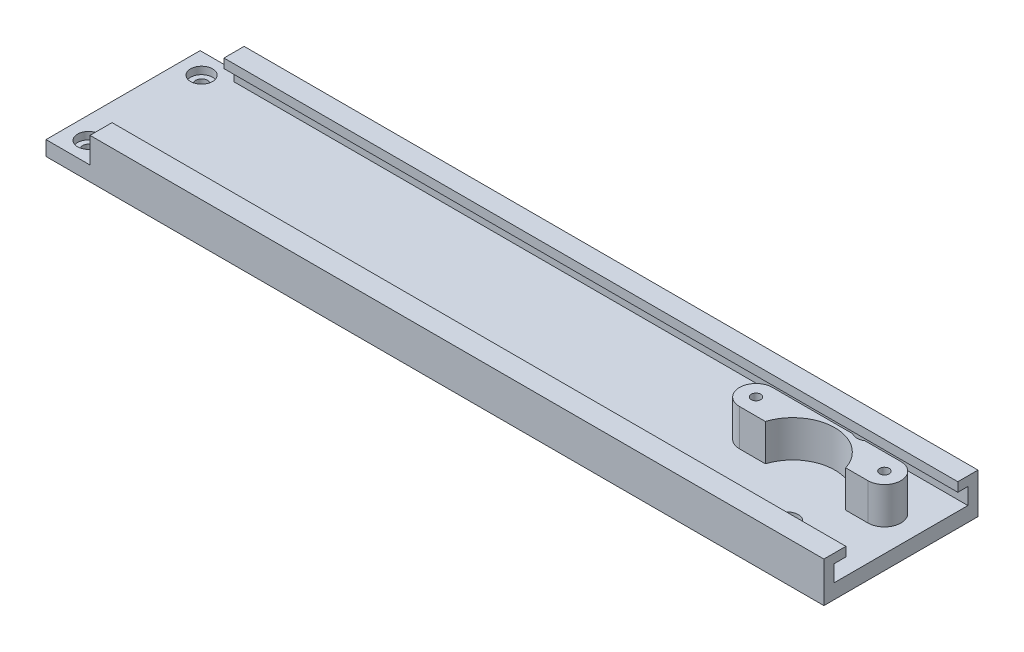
ISO-10303-21;
HEADER;
FILE_DESCRIPTION(('STEP AP214'),'2;1');
FILE_NAME('part.step','',(''),(''),'','','');
FILE_SCHEMA(('AUTOMOTIVE_DESIGN { 1 0 10303 214 1 1 1 1 }'));
ENDSEC;
DATA;
#1=APPLICATION_CONTEXT('core data for automotive mechanical design processes');
#2=APPLICATION_PROTOCOL_DEFINITION('international standard','automotive_design',2000,#1);
#3=PRODUCT_CONTEXT('',#1,'mechanical');
#4=PRODUCT('Part','Part','',(#3));
#5=PRODUCT_RELATED_PRODUCT_CATEGORY('part','',(#4));
#6=PRODUCT_DEFINITION_FORMATION('','',#4);
#7=PRODUCT_DEFINITION_CONTEXT('part definition',#1,'design');
#8=PRODUCT_DEFINITION('design','',#6,#7);
#9=PRODUCT_DEFINITION_SHAPE('','',#8);
#10=(LENGTH_UNIT() NAMED_UNIT(*) SI_UNIT(.MILLI.,.METRE.));
#11=(NAMED_UNIT(*) PLANE_ANGLE_UNIT() SI_UNIT($,.RADIAN.));
#12=(NAMED_UNIT(*) SI_UNIT($,.STERADIAN.) SOLID_ANGLE_UNIT());
#13=UNCERTAINTY_MEASURE_WITH_UNIT(LENGTH_MEASURE(1.E-05),#10,'distance_accuracy_value','');
#14=(GEOMETRIC_REPRESENTATION_CONTEXT(3) GLOBAL_UNCERTAINTY_ASSIGNED_CONTEXT((#13)) GLOBAL_UNIT_ASSIGNED_CONTEXT((#10,
#11,#12)) REPRESENTATION_CONTEXT('',''));
#15=CARTESIAN_POINT('',(0.,0.,0.));
#16=DIRECTION('',(0.,0.,1.));
#17=DIRECTION('',(1.,0.,0.));
#18=AXIS2_PLACEMENT_3D('',#15,#16,#17);
#19=CARTESIAN_POINT('',(61.5,14.,-9.49999999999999));
#20=DIRECTION('',(0.,0.,1.));
#21=DIRECTION('',(1.,0.,0.));
#22=AXIS2_PLACEMENT_3D('',#19,#20,#21);
#23=PLANE('',#22);
#24=DIRECTION('',(-1.,0.,0.));
#25=VECTOR('',#24,1.);
#26=CARTESIAN_POINT('',(61.5,4.,-9.49999999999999));
#27=LINE('',#26,#25);
#28=CARTESIAN_POINT('',(96.5,4.,-9.49999999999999));
#29=VERTEX_POINT('',#28);
#30=CARTESIAN_POINT('',(86.6583123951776,4.,-9.49999999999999));
#31=VERTEX_POINT('',#30);
#32=EDGE_CURVE('E208',#29,#31,#27,.T.);
#33=ORIENTED_EDGE('',*,*,#32,.T.);
#34=DIRECTION('',(0.,1.,0.));
#35=VECTOR('',#34,1.);
#36=CARTESIAN_POINT('',(86.6583123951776,-0.000999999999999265,-9.49999999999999));
#37=LINE('',#36,#35);
#38=CARTESIAN_POINT('',(86.6583123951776,14.,-9.49999999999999));
#39=VERTEX_POINT('',#38);
#40=EDGE_CURVE('E195',#39,#31,#37,.F.);
#41=ORIENTED_EDGE('',*,*,#40,.F.);
#42=DIRECTION('',(-1.,0.,0.));
#43=VECTOR('',#42,1.);
#44=CARTESIAN_POINT('',(61.5,14.,-9.49999999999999));
#45=LINE('',#44,#43);
#46=CARTESIAN_POINT('',(96.5,14.,-9.49999999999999));
#47=VERTEX_POINT('',#46);
#48=EDGE_CURVE('E207',#47,#39,#45,.T.);
#49=ORIENTED_EDGE('',*,*,#48,.F.);
#50=DIRECTION('',(0.,-1.,0.));
#51=VECTOR('',#50,1.);
#52=CARTESIAN_POINT('',(96.5,14.,-9.49999999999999));
#53=LINE('',#52,#51);
#54=EDGE_CURVE('E219',#47,#29,#53,.T.);
#55=ORIENTED_EDGE('',*,*,#54,.T.);
#56=EDGE_LOOP('',(#33,#41,#49,#55));
#57=FACE_BOUND('',#56,.T.);
#58=ADVANCED_FACE('F42',(#57),#23,.F.);
#59=CARTESIAN_POINT('',(61.5,14.,-0.499999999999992));
#60=DIRECTION('',(0.,0.,-1.));
#61=DIRECTION('',(-1.,0.,0.));
#62=AXIS2_PLACEMENT_3D('',#59,#60,#61);
#63=PLANE('',#62);
#64=DIRECTION('',(1.,0.,0.));
#65=VECTOR('',#64,1.);
#66=CARTESIAN_POINT('',(61.5,4.,-0.499999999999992));
#67=LINE('',#66,#65);
#68=CARTESIAN_POINT('',(61.5,4.,-0.499999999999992));
#69=VERTEX_POINT('',#68);
#70=CARTESIAN_POINT('',(68.5455488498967,4.,-0.499999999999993));
#71=VERTEX_POINT('',#70);
#72=EDGE_CURVE('E64',#69,#71,#67,.T.);
#73=ORIENTED_EDGE('',*,*,#72,.T.);
#74=DIRECTION('',(0.,1.,0.));
#75=VECTOR('',#74,1.);
#76=CARTESIAN_POINT('',(68.5455488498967,-28.5269119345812,-0.499999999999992));
#77=LINE('',#76,#75);
#78=CARTESIAN_POINT('',(68.5455488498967,14.,-0.499999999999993));
#79=VERTEX_POINT('',#78);
#80=EDGE_CURVE('E11',#71,#79,#77,.T.);
#81=ORIENTED_EDGE('',*,*,#80,.T.);
#82=DIRECTION('',(1.,0.,0.));
#83=VECTOR('',#82,1.);
#84=CARTESIAN_POINT('',(61.5,14.,-0.499999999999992));
#85=LINE('',#84,#83);
#86=CARTESIAN_POINT('',(61.5,14.,-0.499999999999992));
#87=VERTEX_POINT('',#86);
#88=EDGE_CURVE('E386',#87,#79,#85,.T.);
#89=ORIENTED_EDGE('',*,*,#88,.F.);
#90=DIRECTION('',(0.,-1.,0.));
#91=VECTOR('',#90,1.);
#92=CARTESIAN_POINT('',(61.5,14.,-0.499999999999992));
#93=LINE('',#92,#91);
#94=EDGE_CURVE('E240',#87,#69,#93,.T.);
#95=ORIENTED_EDGE('',*,*,#94,.T.);
#96=EDGE_LOOP('',(#73,#81,#89,#95));
#97=FACE_BOUND('',#96,.T.);
#98=ADVANCED_FACE('F429',(#97),#63,.F.);
#99=CARTESIAN_POINT('',(-106.,4.,21.));
#100=DIRECTION('',(-1.,0.,0.));
#101=DIRECTION('',(0.,0.,1.));
#102=AXIS2_PLACEMENT_3D('',#99,#100,#101);
#103=PLANE('',#102);
#104=DIRECTION('',(0.,0.,-1.));
#105=VECTOR('',#104,1.);
#106=CARTESIAN_POINT('',(-106.,0.,21.));
#107=LINE('',#106,#105);
#108=CARTESIAN_POINT('',(-106.,0.,21.));
#109=VERTEX_POINT('',#108);
#110=CARTESIAN_POINT('',(-106.,0.,-21.));
#111=VERTEX_POINT('',#110);
#112=EDGE_CURVE('E345',#109,#111,#107,.T.);
#113=ORIENTED_EDGE('',*,*,#112,.F.);
#114=DIRECTION('',(0.,-1.,0.));
#115=VECTOR('',#114,1.);
#116=CARTESIAN_POINT('',(-106.,4.,21.));
#117=LINE('',#116,#115);
#118=CARTESIAN_POINT('',(-106.,4.,21.));
#119=VERTEX_POINT('',#118);
#120=EDGE_CURVE('E366',#119,#109,#117,.T.);
#121=ORIENTED_EDGE('',*,*,#120,.F.);
#122=DIRECTION('',(0.,0.,-1.));
#123=VECTOR('',#122,1.);
#124=CARTESIAN_POINT('',(-106.,4.,21.));
#125=LINE('',#124,#123);
#126=CARTESIAN_POINT('',(-106.,4.,-21.));
#127=VERTEX_POINT('',#126);
#128=EDGE_CURVE('E346',#119,#127,#125,.T.);
#129=ORIENTED_EDGE('',*,*,#128,.T.);
#130=DIRECTION('',(0.,-1.,0.));
#131=VECTOR('',#130,1.);
#132=CARTESIAN_POINT('',(-106.,4.,-21.));
#133=LINE('',#132,#131);
#134=EDGE_CURVE('E357',#127,#111,#133,.T.);
#135=ORIENTED_EDGE('',*,*,#134,.T.);
#136=EDGE_LOOP('',(#113,#121,#129,#135));
#137=FACE_BOUND('',#136,.T.);
#138=ADVANCED_FACE('F44',(#137),#103,.T.);
#139=CARTESIAN_POINT('',(-106.,4.,21.));
#140=DIRECTION('',(0.,0.,-1.));
#141=DIRECTION('',(-1.,0.,0.));
#142=AXIS2_PLACEMENT_3D('',#139,#140,#141);
#143=PLANE('',#142);
#144=DIRECTION('',(1.,0.,0.));
#145=VECTOR('',#144,1.);
#146=CARTESIAN_POINT('',(-106.,0.,21.));
#147=LINE('',#146,#145);
#148=CARTESIAN_POINT('',(106.,0.,21.));
#149=VERTEX_POINT('',#148);
#150=EDGE_CURVE('E350',#109,#149,#147,.T.);
#151=ORIENTED_EDGE('',*,*,#150,.T.);
#152=DIRECTION('',(0.,-1.,0.));
#153=VECTOR('',#152,1.);
#154=CARTESIAN_POINT('',(106.,4.,21.));
#155=LINE('',#154,#153);
#156=CARTESIAN_POINT('',(106.,11.,21.));
#157=VERTEX_POINT('',#156);
#158=EDGE_CURVE('E368',#157,#149,#155,.T.);
#159=ORIENTED_EDGE('',*,*,#158,.F.);
#160=DIRECTION('',(1.,0.,0.));
#161=VECTOR('',#160,1.);
#162=CARTESIAN_POINT('',(-94.,11.,21.));
#163=LINE('',#162,#161);
#164=CARTESIAN_POINT('',(-94.,11.,21.));
#165=VERTEX_POINT('',#164);
#166=EDGE_CURVE('E331',#165,#157,#163,.T.);
#167=ORIENTED_EDGE('',*,*,#166,.F.);
#168=DIRECTION('',(0.,-1.,0.));
#169=VECTOR('',#168,1.);
#170=CARTESIAN_POINT('',(-94.,0.,21.));
#171=LINE('',#170,#169);
#172=CARTESIAN_POINT('',(-94.,4.,21.));
#173=VERTEX_POINT('',#172);
#174=EDGE_CURVE('E318',#165,#173,#171,.T.);
#175=ORIENTED_EDGE('',*,*,#174,.T.);
#176=DIRECTION('',(1.,0.,0.));
#177=VECTOR('',#176,1.);
#178=CARTESIAN_POINT('',(-106.,4.,21.));
#179=LINE('',#178,#177);
#180=EDGE_CURVE('E355',#119,#173,#179,.T.);
#181=ORIENTED_EDGE('',*,*,#180,.F.);
#182=ORIENTED_EDGE('',*,*,#120,.T.);
#183=EDGE_LOOP('',(#151,#159,#167,#175,#181,#182));
#184=FACE_BOUND('',#183,.T.);
#185=ADVANCED_FACE('F458',(#184),#143,.F.);
#186=CARTESIAN_POINT('',(106.,4.,21.));
#187=DIRECTION('',(-1.,0.,0.));
#188=DIRECTION('',(0.,0.,1.));
#189=AXIS2_PLACEMENT_3D('',#186,#187,#188);
#190=PLANE('',#189);
#191=DIRECTION('',(0.,0.,-1.));
#192=VECTOR('',#191,1.);
#193=CARTESIAN_POINT('',(106.,0.,21.));
#194=LINE('',#193,#192);
#195=CARTESIAN_POINT('',(106.,0.,-21.));
#196=VERTEX_POINT('',#195);
#197=EDGE_CURVE('E362',#149,#196,#194,.T.);
#198=ORIENTED_EDGE('',*,*,#197,.T.);
#199=DIRECTION('',(0.,-1.,0.));
#200=VECTOR('',#199,1.);
#201=CARTESIAN_POINT('',(106.,4.,-21.));
#202=LINE('',#201,#200);
#203=CARTESIAN_POINT('',(106.,11.,-21.));
#204=VERTEX_POINT('',#203);
#205=EDGE_CURVE('E371',#204,#196,#202,.T.);
#206=ORIENTED_EDGE('',*,*,#205,.F.);
#207=DIRECTION('',(0.,0.,1.));
#208=VECTOR('',#207,1.);
#209=CARTESIAN_POINT('',(106.,11.,-21.));
#210=LINE('',#209,#208);
#211=CARTESIAN_POINT('',(106.,11.,-15.5));
#212=VERTEX_POINT('',#211);
#213=EDGE_CURVE('E279',#204,#212,#210,.T.);
#214=ORIENTED_EDGE('',*,*,#213,.T.);
#215=DIRECTION('',(0.,-1.,0.));
#216=VECTOR('',#215,1.);
#217=CARTESIAN_POINT('',(106.,11.,-15.5));
#218=LINE('',#217,#216);
#219=CARTESIAN_POINT('',(106.,8.5,-15.5));
#220=VERTEX_POINT('',#219);
#221=EDGE_CURVE('E276',#212,#220,#218,.T.);
#222=ORIENTED_EDGE('',*,*,#221,.T.);
#223=DIRECTION('',(0.,0.,-1.));
#224=VECTOR('',#223,1.);
#225=CARTESIAN_POINT('',(106.,8.5,-15.5));
#226=LINE('',#225,#224);
#227=CARTESIAN_POINT('',(106.,8.5,-18.25));
#228=VERTEX_POINT('',#227);
#229=EDGE_CURVE('E286',#220,#228,#226,.T.);
#230=ORIENTED_EDGE('',*,*,#229,.T.);
#231=DIRECTION('',(0.,-1.,0.));
#232=VECTOR('',#231,1.);
#233=CARTESIAN_POINT('',(106.,8.5,-18.25));
#234=LINE('',#233,#232);
#235=CARTESIAN_POINT('',(106.,4.,-18.25));
#236=VERTEX_POINT('',#235);
#237=EDGE_CURVE('E283',#228,#236,#234,.T.);
#238=ORIENTED_EDGE('',*,*,#237,.T.);
#239=DIRECTION('',(0.,0.,-1.));
#240=VECTOR('',#239,1.);
#241=CARTESIAN_POINT('',(106.,4.,21.));
#242=LINE('',#241,#240);
#243=CARTESIAN_POINT('',(106.,4.,18.25));
#244=VERTEX_POINT('',#243);
#245=EDGE_CURVE('E353',#244,#236,#242,.T.);
#246=ORIENTED_EDGE('',*,*,#245,.F.);
#247=DIRECTION('',(0.,1.,0.));
#248=VECTOR('',#247,1.);
#249=CARTESIAN_POINT('',(106.,8.5,18.25));
#250=LINE('',#249,#248);
#251=CARTESIAN_POINT('',(106.,8.5,18.25));
#252=VERTEX_POINT('',#251);
#253=EDGE_CURVE('E305',#244,#252,#250,.T.);
#254=ORIENTED_EDGE('',*,*,#253,.T.);
#255=DIRECTION('',(0.,0.,-1.));
#256=VECTOR('',#255,1.);
#257=CARTESIAN_POINT('',(106.,8.5,15.));
#258=LINE('',#257,#256);
#259=CARTESIAN_POINT('',(106.,8.5,15.));
#260=VERTEX_POINT('',#259);
#261=EDGE_CURVE('E323',#252,#260,#258,.T.);
#262=ORIENTED_EDGE('',*,*,#261,.T.);
#263=DIRECTION('',(0.,1.,0.));
#264=VECTOR('',#263,1.);
#265=CARTESIAN_POINT('',(106.,11.,15.));
#266=LINE('',#265,#264);
#267=CARTESIAN_POINT('',(106.,11.,15.));
#268=VERTEX_POINT('',#267);
#269=EDGE_CURVE('E326',#260,#268,#266,.T.);
#270=ORIENTED_EDGE('',*,*,#269,.T.);
#271=DIRECTION('',(0.,0.,1.));
#272=VECTOR('',#271,1.);
#273=CARTESIAN_POINT('',(106.,11.,21.));
#274=LINE('',#273,#272);
#275=EDGE_CURVE('E309',#268,#157,#274,.T.);
#276=ORIENTED_EDGE('',*,*,#275,.T.);
#277=ORIENTED_EDGE('',*,*,#158,.T.);
#278=EDGE_LOOP('',(#198,#206,#214,#222,#230,#238,#246,#254,#262,#270,#276,#277));
#279=FACE_BOUND('',#278,.T.);
#280=ADVANCED_FACE('F545',(#279),#190,.F.);
#281=CARTESIAN_POINT('',(-106.,4.,-21.));
#282=DIRECTION('',(0.,0.,-1.));
#283=DIRECTION('',(-1.,0.,0.));
#284=AXIS2_PLACEMENT_3D('',#281,#282,#283);
#285=PLANE('',#284);
#286=DIRECTION('',(1.,0.,0.));
#287=VECTOR('',#286,1.);
#288=CARTESIAN_POINT('',(-106.,4.,-21.));
#289=LINE('',#288,#287);
#290=CARTESIAN_POINT('',(-94.,4.,-21.));
#291=VERTEX_POINT('',#290);
#292=EDGE_CURVE('E349',#127,#291,#289,.T.);
#293=ORIENTED_EDGE('',*,*,#292,.T.);
#294=DIRECTION('',(0.,1.,0.));
#295=VECTOR('',#294,1.);
#296=CARTESIAN_POINT('',(-94.,0.,-21.));
#297=LINE('',#296,#295);
#298=CARTESIAN_POINT('',(-94.,11.,-21.));
#299=VERTEX_POINT('',#298);
#300=EDGE_CURVE('E295',#291,#299,#297,.T.);
#301=ORIENTED_EDGE('',*,*,#300,.T.);
#302=DIRECTION('',(1.,0.,0.));
#303=VECTOR('',#302,1.);
#304=CARTESIAN_POINT('',(-94.,11.,-21.));
#305=LINE('',#304,#303);
#306=EDGE_CURVE('E270',#299,#204,#305,.T.);
#307=ORIENTED_EDGE('',*,*,#306,.T.);
#308=ORIENTED_EDGE('',*,*,#205,.T.);
#309=DIRECTION('',(1.,0.,0.));
#310=VECTOR('',#309,1.);
#311=CARTESIAN_POINT('',(-106.,0.,-21.));
#312=LINE('',#311,#310);
#313=EDGE_CURVE('E360',#111,#196,#312,.T.);
#314=ORIENTED_EDGE('',*,*,#313,.F.);
#315=ORIENTED_EDGE('',*,*,#134,.F.);
#316=EDGE_LOOP('',(#293,#301,#307,#308,#314,#315));
#317=FACE_BOUND('',#316,.T.);
#318=ADVANCED_FACE('F536',(#317),#285,.T.);
#319=CARTESIAN_POINT('',(0.,4.,0.));
#320=DIRECTION('',(0.,-1.,0.));
#321=DIRECTION('',(0.,0.,-1.));
#322=AXIS2_PLACEMENT_3D('',#319,#320,#321);
#323=PLANE('',#322);
#324=CARTESIAN_POINT('',(85.,4.,9.99999999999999));
#325=DIRECTION('',(0.,1.,0.));
#326=DIRECTION('',(0.,0.,1.));
#327=AXIS2_PLACEMENT_3D('',#324,#325,#326);
#328=CIRCLE('',#327,3.00000000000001);
#329=CARTESIAN_POINT('',(85.,4.,13.));
#330=VERTEX_POINT('',#329);
#331=EDGE_CURVE('E409',#330,#330,#328,.T.);
#332=ORIENTED_EDGE('',*,*,#331,.F.);
#333=EDGE_LOOP('',(#332));
#334=FACE_BOUND('',#333,.T.);
#335=CARTESIAN_POINT('',(90.4544511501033,4.,-0.499999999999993));
#336=VERTEX_POINT('',#335);
#337=CARTESIAN_POINT('',(96.5,4.,-0.499999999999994));
#338=VERTEX_POINT('',#337);
#339=EDGE_CURVE('E227',#336,#338,#67,.T.);
#340=ORIENTED_EDGE('',*,*,#339,.F.);
#341=CARTESIAN_POINT('',(79.5,4.,3.00000000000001));
#342=DIRECTION('',(0.,-1.,0.));
#343=DIRECTION('',(0.,0.,-1.));
#344=AXIS2_PLACEMENT_3D('',#341,#342,#343);
#345=CIRCLE('',#344,11.5);
#346=EDGE_CURVE('E57',#336,#71,#345,.F.);
#347=ORIENTED_EDGE('',*,*,#346,.T.);
#348=ORIENTED_EDGE('',*,*,#72,.F.);
#349=CARTESIAN_POINT('',(61.5,4.,-4.99999999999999));
#350=DIRECTION('',(0.,1.,0.));
#351=DIRECTION('',(0.,0.,1.));
#352=AXIS2_PLACEMENT_3D('',#349,#350,#351);
#353=CIRCLE('',#352,4.5);
#354=CARTESIAN_POINT('',(61.5,4.,-9.49999999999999));
#355=VERTEX_POINT('',#354);
#356=EDGE_CURVE('E224',#355,#69,#353,.T.);
#357=ORIENTED_EDGE('',*,*,#356,.F.);
#358=CARTESIAN_POINT('',(83.3416876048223,4.,-9.49999999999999));
#359=VERTEX_POINT('',#358);
#360=EDGE_CURVE('E233',#359,#355,#27,.T.);
#361=ORIENTED_EDGE('',*,*,#360,.F.);
#362=CARTESIAN_POINT('',(85.,4.,-12.));
#363=DIRECTION('',(0.,1.,0.));
#364=DIRECTION('',(0.,0.,1.));
#365=AXIS2_PLACEMENT_3D('',#362,#363,#364);
#366=CIRCLE('',#365,3.00000000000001);
#367=EDGE_CURVE('E406',#31,#359,#366,.T.);
#368=ORIENTED_EDGE('',*,*,#367,.F.);
#369=ORIENTED_EDGE('',*,*,#32,.F.);
#370=CARTESIAN_POINT('',(96.5,4.,-4.99999999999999));
#371=DIRECTION('',(0.,1.,0.));
#372=DIRECTION('',(0.,0.,1.));
#373=AXIS2_PLACEMENT_3D('',#370,#371,#372);
#374=CIRCLE('',#373,4.5);
#375=EDGE_CURVE('E230',#338,#29,#374,.T.);
#376=ORIENTED_EDGE('',*,*,#375,.F.);
#377=EDGE_LOOP('',(#340,#347,#348,#357,#361,#368,#369,#376));
#378=FACE_BOUND('',#377,.T.);
#379=CARTESIAN_POINT('',(-100.,4.,-15.4));
#380=DIRECTION('',(0.,-1.,0.));
#381=DIRECTION('',(0.,0.,-1.));
#382=AXIS2_PLACEMENT_3D('',#379,#380,#381);
#383=CIRCLE('',#382,3.00000000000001);
#384=CARTESIAN_POINT('',(-100.,4.,-18.4));
#385=VERTEX_POINT('',#384);
#386=EDGE_CURVE('E246',#385,#385,#383,.T.);
#387=ORIENTED_EDGE('',*,*,#386,.T.);
#388=EDGE_LOOP('',(#387));
#389=FACE_BOUND('',#388,.T.);
#390=CARTESIAN_POINT('',(-100.,4.,15.4));
#391=DIRECTION('',(0.,1.,0.));
#392=DIRECTION('',(0.,0.,1.));
#393=AXIS2_PLACEMENT_3D('',#390,#391,#392);
#394=CIRCLE('',#393,3.00000000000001);
#395=CARTESIAN_POINT('',(-100.,4.,18.4));
#396=VERTEX_POINT('',#395);
#397=EDGE_CURVE('E258',#396,#396,#394,.T.);
#398=ORIENTED_EDGE('',*,*,#397,.F.);
#399=EDGE_LOOP('',(#398));
#400=FACE_BOUND('',#399,.T.);
#401=ORIENTED_EDGE('',*,*,#245,.T.);
#402=DIRECTION('',(-1.,0.,0.));
#403=VECTOR('',#402,1.);
#404=CARTESIAN_POINT('',(0.,4.,-18.25));
#405=LINE('',#404,#403);
#406=CARTESIAN_POINT('',(-94.,4.,-18.25));
#407=VERTEX_POINT('',#406);
#408=EDGE_CURVE('E303',#236,#407,#405,.T.);
#409=ORIENTED_EDGE('',*,*,#408,.T.);
#410=DIRECTION('',(0.,0.,-1.));
#411=VECTOR('',#410,1.);
#412=CARTESIAN_POINT('',(-94.,4.,0.));
#413=LINE('',#412,#411);
#414=EDGE_CURVE('E289',#407,#291,#413,.T.);
#415=ORIENTED_EDGE('',*,*,#414,.T.);
#416=ORIENTED_EDGE('',*,*,#292,.F.);
#417=ORIENTED_EDGE('',*,*,#128,.F.);
#418=ORIENTED_EDGE('',*,*,#180,.T.);
#419=DIRECTION('',(0.,0.,-1.));
#420=VECTOR('',#419,1.);
#421=CARTESIAN_POINT('',(-94.,4.,0.));
#422=LINE('',#421,#420);
#423=CARTESIAN_POINT('',(-94.,4.,18.25));
#424=VERTEX_POINT('',#423);
#425=EDGE_CURVE('E334',#173,#424,#422,.T.);
#426=ORIENTED_EDGE('',*,*,#425,.T.);
#427=DIRECTION('',(1.,0.,0.));
#428=VECTOR('',#427,1.);
#429=CARTESIAN_POINT('',(0.,4.,18.25));
#430=LINE('',#429,#428);
#431=EDGE_CURVE('E342',#424,#244,#430,.T.);
#432=ORIENTED_EDGE('',*,*,#431,.T.);
#433=EDGE_LOOP('',(#401,#409,#415,#416,#417,#418,#426,#432));
#434=FACE_BOUND('',#433,.T.);
#435=ADVANCED_FACE('F382',(#334,#378,#389,#400,#434),#323,.F.);
#436=CARTESIAN_POINT('',(0.,0.,0.));
#437=DIRECTION('',(0.,-1.,0.));
#438=DIRECTION('',(0.,0.,-1.));
#439=AXIS2_PLACEMENT_3D('',#436,#437,#438);
#440=PLANE('',#439);
#441=CARTESIAN_POINT('',(85.,0.,-12.));
#442=DIRECTION('',(0.,1.,0.));
#443=DIRECTION('',(0.,0.,1.));
#444=AXIS2_PLACEMENT_3D('',#441,#442,#443);
#445=CIRCLE('',#444,1.6);
#446=CARTESIAN_POINT('',(85.,0.,-10.4));
#447=VERTEX_POINT('',#446);
#448=EDGE_CURVE('E407',#447,#447,#445,.T.);
#449=ORIENTED_EDGE('',*,*,#448,.T.);
#450=EDGE_LOOP('',(#449));
#451=FACE_BOUND('',#450,.T.);
#452=CARTESIAN_POINT('',(85.,0.,9.99999999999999));
#453=DIRECTION('',(0.,1.,0.));
#454=DIRECTION('',(0.,0.,1.));
#455=AXIS2_PLACEMENT_3D('',#452,#453,#454);
#456=CIRCLE('',#455,1.6);
#457=CARTESIAN_POINT('',(85.,0.,11.6));
#458=VERTEX_POINT('',#457);
#459=EDGE_CURVE('E414',#458,#458,#456,.T.);
#460=ORIENTED_EDGE('',*,*,#459,.T.);
#461=EDGE_LOOP('',(#460));
#462=FACE_BOUND('',#461,.T.);
#463=CARTESIAN_POINT('',(-100.,0.,-15.4));
#464=DIRECTION('',(0.,-1.,0.));
#465=DIRECTION('',(0.,0.,-1.));
#466=AXIS2_PLACEMENT_3D('',#463,#464,#465);
#467=CIRCLE('',#466,1.6);
#468=CARTESIAN_POINT('',(-100.,0.,-17.));
#469=VERTEX_POINT('',#468);
#470=EDGE_CURVE('E243',#469,#469,#467,.T.);
#471=ORIENTED_EDGE('',*,*,#470,.F.);
#472=EDGE_LOOP('',(#471));
#473=FACE_BOUND('',#472,.T.);
#474=CARTESIAN_POINT('',(-100.,0.,15.4));
#475=DIRECTION('',(0.,1.,0.));
#476=DIRECTION('',(0.,0.,1.));
#477=AXIS2_PLACEMENT_3D('',#474,#475,#476);
#478=CIRCLE('',#477,1.6);
#479=CARTESIAN_POINT('',(-100.,0.,17.));
#480=VERTEX_POINT('',#479);
#481=EDGE_CURVE('E255',#480,#480,#478,.T.);
#482=ORIENTED_EDGE('',*,*,#481,.T.);
#483=EDGE_LOOP('',(#482));
#484=FACE_BOUND('',#483,.T.);
#485=ORIENTED_EDGE('',*,*,#313,.T.);
#486=ORIENTED_EDGE('',*,*,#197,.F.);
#487=ORIENTED_EDGE('',*,*,#150,.F.);
#488=ORIENTED_EDGE('',*,*,#112,.T.);
#489=EDGE_LOOP('',(#485,#486,#487,#488));
#490=FACE_BOUND('',#489,.T.);
#491=ADVANCED_FACE('F532',(#451,#462,#473,#484,#490),#440,.T.);
#492=CARTESIAN_POINT('',(-94.,8.5,18.25));
#493=DIRECTION('',(0.,0.,-1.));
#494=DIRECTION('',(-1.,0.,0.));
#495=AXIS2_PLACEMENT_3D('',#492,#493,#494);
#496=PLANE('',#495);
#497=ORIENTED_EDGE('',*,*,#431,.F.);
#498=DIRECTION('',(0.,1.,0.));
#499=VECTOR('',#498,1.);
#500=CARTESIAN_POINT('',(-94.,8.5,18.25));
#501=LINE('',#500,#499);
#502=CARTESIAN_POINT('',(-94.,8.5,18.25));
#503=VERTEX_POINT('',#502);
#504=EDGE_CURVE('E306',#424,#503,#501,.T.);
#505=ORIENTED_EDGE('',*,*,#504,.T.);
#506=DIRECTION('',(1.,0.,0.));
#507=VECTOR('',#506,1.);
#508=CARTESIAN_POINT('',(-94.,8.5,18.25));
#509=LINE('',#508,#507);
#510=EDGE_CURVE('E321',#503,#252,#509,.T.);
#511=ORIENTED_EDGE('',*,*,#510,.T.);
#512=ORIENTED_EDGE('',*,*,#253,.F.);
#513=EDGE_LOOP('',(#497,#505,#511,#512));
#514=FACE_BOUND('',#513,.T.);
#515=ADVANCED_FACE('F518',(#514),#496,.T.);
#516=CARTESIAN_POINT('',(-94.,0.,0.));
#517=DIRECTION('',(-1.,0.,0.));
#518=DIRECTION('',(0.,0.,1.));
#519=AXIS2_PLACEMENT_3D('',#516,#517,#518);
#520=PLANE('',#519);
#521=ORIENTED_EDGE('',*,*,#425,.F.);
#522=ORIENTED_EDGE('',*,*,#174,.F.);
#523=DIRECTION('',(0.,0.,1.));
#524=VECTOR('',#523,1.);
#525=CARTESIAN_POINT('',(-94.,11.,21.));
#526=LINE('',#525,#524);
#527=CARTESIAN_POINT('',(-94.,11.,15.));
#528=VERTEX_POINT('',#527);
#529=EDGE_CURVE('E315',#528,#165,#526,.T.);
#530=ORIENTED_EDGE('',*,*,#529,.F.);
#531=DIRECTION('',(0.,1.,0.));
#532=VECTOR('',#531,1.);
#533=CARTESIAN_POINT('',(-94.,11.,15.));
#534=LINE('',#533,#532);
#535=CARTESIAN_POINT('',(-94.,8.5,15.));
#536=VERTEX_POINT('',#535);
#537=EDGE_CURVE('E312',#536,#528,#534,.T.);
#538=ORIENTED_EDGE('',*,*,#537,.F.);
#539=DIRECTION('',(0.,0.,-1.));
#540=VECTOR('',#539,1.);
#541=CARTESIAN_POINT('',(-94.,8.5,15.));
#542=LINE('',#541,#540);
#543=EDGE_CURVE('E308',#503,#536,#542,.T.);
#544=ORIENTED_EDGE('',*,*,#543,.F.);
#545=ORIENTED_EDGE('',*,*,#504,.F.);
#546=EDGE_LOOP('',(#521,#522,#530,#538,#544,#545));
#547=FACE_BOUND('',#546,.T.);
#548=ADVANCED_FACE('F514',(#547),#520,.T.);
#549=CARTESIAN_POINT('',(-94.,11.,21.));
#550=DIRECTION('',(0.,1.,0.));
#551=DIRECTION('',(0.,0.,1.));
#552=AXIS2_PLACEMENT_3D('',#549,#550,#551);
#553=PLANE('',#552);
#554=ORIENTED_EDGE('',*,*,#275,.F.);
#555=DIRECTION('',(1.,0.,0.));
#556=VECTOR('',#555,1.);
#557=CARTESIAN_POINT('',(-94.,11.,15.));
#558=LINE('',#557,#556);
#559=EDGE_CURVE('E335',#528,#268,#558,.T.);
#560=ORIENTED_EDGE('',*,*,#559,.F.);
#561=ORIENTED_EDGE('',*,*,#529,.T.);
#562=ORIENTED_EDGE('',*,*,#166,.T.);
#563=EDGE_LOOP('',(#554,#560,#561,#562));
#564=FACE_BOUND('',#563,.T.);
#565=ADVANCED_FACE('F517',(#564),#553,.T.);
#566=CARTESIAN_POINT('',(-94.,11.,15.));
#567=DIRECTION('',(0.,0.,-1.));
#568=DIRECTION('',(-1.,0.,0.));
#569=AXIS2_PLACEMENT_3D('',#566,#567,#568);
#570=PLANE('',#569);
#571=ORIENTED_EDGE('',*,*,#269,.F.);
#572=DIRECTION('',(1.,0.,0.));
#573=VECTOR('',#572,1.);
#574=CARTESIAN_POINT('',(-94.,8.5,15.));
#575=LINE('',#574,#573);
#576=EDGE_CURVE('E337',#536,#260,#575,.T.);
#577=ORIENTED_EDGE('',*,*,#576,.F.);
#578=ORIENTED_EDGE('',*,*,#537,.T.);
#579=ORIENTED_EDGE('',*,*,#559,.T.);
#580=EDGE_LOOP('',(#571,#577,#578,#579));
#581=FACE_BOUND('',#580,.T.);
#582=ADVANCED_FACE('F522',(#581),#570,.T.);
#583=CARTESIAN_POINT('',(-94.,8.5,15.));
#584=DIRECTION('',(0.,-1.,0.));
#585=DIRECTION('',(0.,0.,-1.));
#586=AXIS2_PLACEMENT_3D('',#583,#584,#585);
#587=PLANE('',#586);
#588=ORIENTED_EDGE('',*,*,#261,.F.);
#589=ORIENTED_EDGE('',*,*,#510,.F.);
#590=ORIENTED_EDGE('',*,*,#543,.T.);
#591=ORIENTED_EDGE('',*,*,#576,.T.);
#592=EDGE_LOOP('',(#588,#589,#590,#591));
#593=FACE_BOUND('',#592,.T.);
#594=ADVANCED_FACE('F503',(#593),#587,.T.);
#595=CARTESIAN_POINT('',(-94.,8.5,-18.25));
#596=DIRECTION('',(0.,0.,1.));
#597=DIRECTION('',(1.,0.,0.));
#598=AXIS2_PLACEMENT_3D('',#595,#596,#597);
#599=PLANE('',#598);
#600=ORIENTED_EDGE('',*,*,#408,.F.);
#601=ORIENTED_EDGE('',*,*,#237,.F.);
#602=DIRECTION('',(1.,0.,0.));
#603=VECTOR('',#602,1.);
#604=CARTESIAN_POINT('',(-94.,8.5,-18.25));
#605=LINE('',#604,#603);
#606=CARTESIAN_POINT('',(-94.,8.5,-18.25));
#607=VERTEX_POINT('',#606);
#608=EDGE_CURVE('E267',#607,#228,#605,.T.);
#609=ORIENTED_EDGE('',*,*,#608,.F.);
#610=DIRECTION('',(0.,-1.,0.));
#611=VECTOR('',#610,1.);
#612=CARTESIAN_POINT('',(-94.,8.5,-18.25));
#613=LINE('',#612,#611);
#614=EDGE_CURVE('E297',#607,#407,#613,.T.);
#615=ORIENTED_EDGE('',*,*,#614,.T.);
#616=EDGE_LOOP('',(#600,#601,#609,#615));
#617=FACE_BOUND('',#616,.T.);
#618=ADVANCED_FACE('F500',(#617),#599,.T.);
#619=CARTESIAN_POINT('',(-94.,0.,0.));
#620=DIRECTION('',(-1.,0.,0.));
#621=DIRECTION('',(0.,0.,1.));
#622=AXIS2_PLACEMENT_3D('',#619,#620,#621);
#623=PLANE('',#622);
#624=ORIENTED_EDGE('',*,*,#414,.F.);
#625=ORIENTED_EDGE('',*,*,#614,.F.);
#626=DIRECTION('',(0.,0.,-1.));
#627=VECTOR('',#626,1.);
#628=CARTESIAN_POINT('',(-94.,8.5,-15.5));
#629=LINE('',#628,#627);
#630=CARTESIAN_POINT('',(-94.,8.5,-15.5));
#631=VERTEX_POINT('',#630);
#632=EDGE_CURVE('E280',#631,#607,#629,.T.);
#633=ORIENTED_EDGE('',*,*,#632,.F.);
#634=DIRECTION('',(0.,-1.,0.));
#635=VECTOR('',#634,1.);
#636=CARTESIAN_POINT('',(-94.,11.,-15.5));
#637=LINE('',#636,#635);
#638=CARTESIAN_POINT('',(-94.,11.,-15.5));
#639=VERTEX_POINT('',#638);
#640=EDGE_CURVE('E269',#639,#631,#637,.T.);
#641=ORIENTED_EDGE('',*,*,#640,.F.);
#642=DIRECTION('',(0.,0.,1.));
#643=VECTOR('',#642,1.);
#644=CARTESIAN_POINT('',(-94.,11.,-21.));
#645=LINE('',#644,#643);
#646=EDGE_CURVE('E292',#299,#639,#645,.T.);
#647=ORIENTED_EDGE('',*,*,#646,.F.);
#648=ORIENTED_EDGE('',*,*,#300,.F.);
#649=EDGE_LOOP('',(#624,#625,#633,#641,#647,#648));
#650=FACE_BOUND('',#649,.T.);
#651=ADVANCED_FACE('F498',(#650),#623,.T.);
#652=CARTESIAN_POINT('',(-94.,8.5,-15.5));
#653=DIRECTION('',(0.,-1.,0.));
#654=DIRECTION('',(0.,0.,-1.));
#655=AXIS2_PLACEMENT_3D('',#652,#653,#654);
#656=PLANE('',#655);
#657=ORIENTED_EDGE('',*,*,#229,.F.);
#658=DIRECTION('',(1.,0.,0.));
#659=VECTOR('',#658,1.);
#660=CARTESIAN_POINT('',(-94.,8.5,-15.5));
#661=LINE('',#660,#659);
#662=EDGE_CURVE('E264',#631,#220,#661,.T.);
#663=ORIENTED_EDGE('',*,*,#662,.F.);
#664=ORIENTED_EDGE('',*,*,#632,.T.);
#665=ORIENTED_EDGE('',*,*,#608,.T.);
#666=EDGE_LOOP('',(#657,#663,#664,#665));
#667=FACE_BOUND('',#666,.T.);
#668=ADVANCED_FACE('F494',(#667),#656,.T.);
#669=CARTESIAN_POINT('',(-94.,11.,-15.5));
#670=DIRECTION('',(0.,0.,1.));
#671=DIRECTION('',(1.,0.,0.));
#672=AXIS2_PLACEMENT_3D('',#669,#670,#671);
#673=PLANE('',#672);
#674=ORIENTED_EDGE('',*,*,#221,.F.);
#675=DIRECTION('',(1.,0.,0.));
#676=VECTOR('',#675,1.);
#677=CARTESIAN_POINT('',(-94.,11.,-15.5));
#678=LINE('',#677,#676);
#679=EDGE_CURVE('E273',#639,#212,#678,.T.);
#680=ORIENTED_EDGE('',*,*,#679,.F.);
#681=ORIENTED_EDGE('',*,*,#640,.T.);
#682=ORIENTED_EDGE('',*,*,#662,.T.);
#683=EDGE_LOOP('',(#674,#680,#681,#682));
#684=FACE_BOUND('',#683,.T.);
#685=ADVANCED_FACE('F497',(#684),#673,.T.);
#686=CARTESIAN_POINT('',(-94.,11.,-21.));
#687=DIRECTION('',(0.,1.,0.));
#688=DIRECTION('',(0.,0.,1.));
#689=AXIS2_PLACEMENT_3D('',#686,#687,#688);
#690=PLANE('',#689);
#691=ORIENTED_EDGE('',*,*,#213,.F.);
#692=ORIENTED_EDGE('',*,*,#306,.F.);
#693=ORIENTED_EDGE('',*,*,#646,.T.);
#694=ORIENTED_EDGE('',*,*,#679,.T.);
#695=EDGE_LOOP('',(#691,#692,#693,#694));
#696=FACE_BOUND('',#695,.T.);
#697=ADVANCED_FACE('F492',(#696),#690,.T.);
#698=CARTESIAN_POINT('',(-100.,2.,15.4));
#699=DIRECTION('',(0.,1.,0.));
#700=DIRECTION('',(0.,0.,1.));
#701=AXIS2_PLACEMENT_3D('',#698,#699,#700);
#702=CYLINDRICAL_SURFACE('',#701,3.00000000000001);
#703=CARTESIAN_POINT('',(-100.,2.,15.4));
#704=DIRECTION('',(0.,1.,0.));
#705=DIRECTION('',(0.,0.,1.));
#706=AXIS2_PLACEMENT_3D('',#703,#704,#705);
#707=CIRCLE('',#706,3.00000000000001);
#708=CARTESIAN_POINT('',(-100.,2.,18.4));
#709=VERTEX_POINT('',#708);
#710=EDGE_CURVE('E261',#709,#709,#707,.T.);
#711=ORIENTED_EDGE('',*,*,#710,.F.);
#712=EDGE_LOOP('',(#711));
#713=FACE_BOUND('',#712,.T.);
#714=ORIENTED_EDGE('',*,*,#397,.T.);
#715=EDGE_LOOP('',(#714));
#716=FACE_BOUND('',#715,.T.);
#717=ADVANCED_FACE('F488',(#713,#716),#702,.F.);
#718=CARTESIAN_POINT('',(-100.,2.,15.4));
#719=DIRECTION('',(0.,1.,0.));
#720=DIRECTION('',(0.,0.,1.));
#721=AXIS2_PLACEMENT_3D('',#718,#719,#720);
#722=PLANE('',#721);
#723=CARTESIAN_POINT('',(-100.,2.,15.4));
#724=DIRECTION('',(0.,1.,0.));
#725=DIRECTION('',(0.,0.,1.));
#726=AXIS2_PLACEMENT_3D('',#723,#724,#725);
#727=CIRCLE('',#726,1.6);
#728=CARTESIAN_POINT('',(-100.,2.,17.));
#729=VERTEX_POINT('',#728);
#730=EDGE_CURVE('E252',#729,#729,#727,.T.);
#731=ORIENTED_EDGE('',*,*,#730,.F.);
#732=EDGE_LOOP('',(#731));
#733=FACE_BOUND('',#732,.T.);
#734=ORIENTED_EDGE('',*,*,#710,.T.);
#735=EDGE_LOOP('',(#734));
#736=FACE_BOUND('',#735,.T.);
#737=ADVANCED_FACE('F484',(#733,#736),#722,.T.);
#738=CARTESIAN_POINT('',(-100.,0.,15.4));
#739=DIRECTION('',(0.,1.,0.));
#740=DIRECTION('',(0.,0.,1.));
#741=AXIS2_PLACEMENT_3D('',#738,#739,#740);
#742=CYLINDRICAL_SURFACE('',#741,1.6);
#743=ORIENTED_EDGE('',*,*,#481,.F.);
#744=EDGE_LOOP('',(#743));
#745=FACE_BOUND('',#744,.T.);
#746=ORIENTED_EDGE('',*,*,#730,.T.);
#747=EDGE_LOOP('',(#746));
#748=FACE_BOUND('',#747,.T.);
#749=ADVANCED_FACE('F480',(#745,#748),#742,.F.);
#750=CARTESIAN_POINT('',(-100.,2.,-15.4));
#751=DIRECTION('',(0.,1.,0.));
#752=DIRECTION('',(0.,0.,1.));
#753=AXIS2_PLACEMENT_3D('',#750,#751,#752);
#754=CYLINDRICAL_SURFACE('',#753,3.00000000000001);
#755=CARTESIAN_POINT('',(-100.,2.,-15.4));
#756=DIRECTION('',(0.,-1.,0.));
#757=DIRECTION('',(0.,0.,-1.));
#758=AXIS2_PLACEMENT_3D('',#755,#756,#757);
#759=CIRCLE('',#758,3.00000000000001);
#760=CARTESIAN_POINT('',(-100.,2.,-18.4));
#761=VERTEX_POINT('',#760);
#762=EDGE_CURVE('E249',#761,#761,#759,.T.);
#763=ORIENTED_EDGE('',*,*,#762,.T.);
#764=EDGE_LOOP('',(#763));
#765=FACE_BOUND('',#764,.T.);
#766=ORIENTED_EDGE('',*,*,#386,.F.);
#767=EDGE_LOOP('',(#766));
#768=FACE_BOUND('',#767,.T.);
#769=ADVANCED_FACE('F476',(#765,#768),#754,.F.);
#770=CARTESIAN_POINT('',(-100.,2.,-15.4));
#771=DIRECTION('',(0.,1.,0.));
#772=DIRECTION('',(0.,0.,-1.));
#773=AXIS2_PLACEMENT_3D('',#770,#771,#772);
#774=PLANE('',#773);
#775=CARTESIAN_POINT('',(-100.,2.,-15.4));
#776=DIRECTION('',(0.,-1.,0.));
#777=DIRECTION('',(0.,0.,-1.));
#778=AXIS2_PLACEMENT_3D('',#775,#776,#777);
#779=CIRCLE('',#778,1.6);
#780=CARTESIAN_POINT('',(-100.,2.,-17.));
#781=VERTEX_POINT('',#780);
#782=EDGE_CURVE('E242',#781,#781,#779,.T.);
#783=ORIENTED_EDGE('',*,*,#782,.T.);
#784=EDGE_LOOP('',(#783));
#785=FACE_BOUND('',#784,.T.);
#786=ORIENTED_EDGE('',*,*,#762,.F.);
#787=EDGE_LOOP('',(#786));
#788=FACE_BOUND('',#787,.T.);
#789=ADVANCED_FACE('F472',(#785,#788),#774,.T.);
#790=CARTESIAN_POINT('',(-100.,0.,-15.4));
#791=DIRECTION('',(0.,1.,0.));
#792=DIRECTION('',(0.,0.,1.));
#793=AXIS2_PLACEMENT_3D('',#790,#791,#792);
#794=CYLINDRICAL_SURFACE('',#793,1.6);
#795=ORIENTED_EDGE('',*,*,#470,.T.);
#796=EDGE_LOOP('',(#795));
#797=FACE_BOUND('',#796,.T.);
#798=ORIENTED_EDGE('',*,*,#782,.F.);
#799=EDGE_LOOP('',(#798));
#800=FACE_BOUND('',#799,.T.);
#801=ADVANCED_FACE('F468',(#797,#800),#794,.F.);
#802=CARTESIAN_POINT('',(61.5,14.,-4.99999999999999));
#803=DIRECTION('',(0.,1.,0.));
#804=DIRECTION('',(0.,0.,1.));
#805=AXIS2_PLACEMENT_3D('',#802,#803,#804);
#806=PLANE('',#805);
#807=CARTESIAN_POINT('',(85.,14.,-12.));
#808=DIRECTION('',(0.,1.,0.));
#809=DIRECTION('',(0.,0.,1.));
#810=AXIS2_PLACEMENT_3D('',#807,#808,#809);
#811=CIRCLE('',#810,3.00000000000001);
#812=CARTESIAN_POINT('',(83.3416876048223,14.,-9.49999999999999));
#813=VERTEX_POINT('',#812);
#814=EDGE_CURVE('E191',#813,#39,#811,.T.);
#815=ORIENTED_EDGE('',*,*,#814,.F.);
#816=CARTESIAN_POINT('',(61.5,14.,-9.49999999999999));
#817=VERTEX_POINT('',#816);
#818=EDGE_CURVE('E216',#813,#817,#45,.T.);
#819=ORIENTED_EDGE('',*,*,#818,.T.);
#820=CARTESIAN_POINT('',(61.5,14.,-4.99999999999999));
#821=DIRECTION('',(0.,1.,0.));
#822=DIRECTION('',(0.,0.,1.));
#823=AXIS2_PLACEMENT_3D('',#820,#821,#822);
#824=CIRCLE('',#823,4.5);
#825=EDGE_CURVE('E234',#817,#87,#824,.T.);
#826=ORIENTED_EDGE('',*,*,#825,.T.);
#827=ORIENTED_EDGE('',*,*,#88,.T.);
#828=CARTESIAN_POINT('',(79.5,14.,3.00000000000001));
#829=DIRECTION('',(0.,1.,0.));
#830=DIRECTION('',(0.,0.,1.));
#831=AXIS2_PLACEMENT_3D('',#828,#829,#830);
#832=CIRCLE('',#831,11.5);
#833=CARTESIAN_POINT('',(90.4544511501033,14.,-0.499999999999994));
#834=VERTEX_POINT('',#833);
#835=EDGE_CURVE('E201',#834,#79,#832,.T.);
#836=ORIENTED_EDGE('',*,*,#835,.F.);
#837=CARTESIAN_POINT('',(96.5,14.,-0.499999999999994));
#838=VERTEX_POINT('',#837);
#839=EDGE_CURVE('E380',#834,#838,#85,.T.);
#840=ORIENTED_EDGE('',*,*,#839,.T.);
#841=CARTESIAN_POINT('',(96.5,14.,-4.99999999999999));
#842=DIRECTION('',(0.,1.,0.));
#843=DIRECTION('',(0.,0.,1.));
#844=AXIS2_PLACEMENT_3D('',#841,#842,#843);
#845=CIRCLE('',#844,4.5);
#846=EDGE_CURVE('E213',#838,#47,#845,.T.);
#847=ORIENTED_EDGE('',*,*,#846,.T.);
#848=ORIENTED_EDGE('',*,*,#48,.T.);
#849=EDGE_LOOP('',(#815,#819,#826,#827,#836,#840,#847,#848));
#850=FACE_BOUND('',#849,.T.);
#851=CARTESIAN_POINT('',(96.5,14.,-4.99999999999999));
#852=DIRECTION('',(0.,1.,0.));
#853=DIRECTION('',(0.,0.,1.));
#854=AXIS2_PLACEMENT_3D('',#851,#852,#853);
#855=CIRCLE('',#854,1.29999999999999);
#856=CARTESIAN_POINT('',(96.5,14.,-3.7));
#857=VERTEX_POINT('',#856);
#858=EDGE_CURVE('E228',#857,#857,#855,.T.);
#859=ORIENTED_EDGE('',*,*,#858,.F.);
#860=EDGE_LOOP('',(#859));
#861=FACE_BOUND('',#860,.T.);
#862=CARTESIAN_POINT('',(61.5,14.,-4.99999999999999));
#863=DIRECTION('',(0.,1.,0.));
#864=DIRECTION('',(0.,0.,1.));
#865=AXIS2_PLACEMENT_3D('',#862,#863,#864);
#866=CIRCLE('',#865,1.29999999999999);
#867=CARTESIAN_POINT('',(61.5,14.,-3.7));
#868=VERTEX_POINT('',#867);
#869=EDGE_CURVE('E394',#868,#868,#866,.T.);
#870=ORIENTED_EDGE('',*,*,#869,.F.);
#871=EDGE_LOOP('',(#870));
#872=FACE_BOUND('',#871,.T.);
#873=ADVANCED_FACE('F210',(#850,#861,#872),#806,.T.);
#874=CARTESIAN_POINT('',(61.5,14.,-4.99999999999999));
#875=DIRECTION('',(0.,-1.,0.));
#876=DIRECTION('',(0.,0.,-1.));
#877=AXIS2_PLACEMENT_3D('',#874,#875,#876);
#878=CYLINDRICAL_SURFACE('',#877,4.5);
#879=ORIENTED_EDGE('',*,*,#356,.T.);
#880=ORIENTED_EDGE('',*,*,#94,.F.);
#881=ORIENTED_EDGE('',*,*,#825,.F.);
#882=DIRECTION('',(0.,-1.,0.));
#883=VECTOR('',#882,1.);
#884=CARTESIAN_POINT('',(61.5,14.,-9.49999999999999));
#885=LINE('',#884,#883);
#886=EDGE_CURVE('E215',#817,#355,#885,.T.);
#887=ORIENTED_EDGE('',*,*,#886,.T.);
#888=EDGE_LOOP('',(#879,#880,#881,#887));
#889=FACE_BOUND('',#888,.T.);
#890=ADVANCED_FACE('F433',(#889),#878,.T.);
#891=ORIENTED_EDGE('',*,*,#839,.F.);
#892=DIRECTION('',(0.,1.,0.));
#893=VECTOR('',#892,1.);
#894=CARTESIAN_POINT('',(90.4544511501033,-28.5269119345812,-0.499999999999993));
#895=LINE('',#894,#893);
#896=EDGE_CURVE('E50',#834,#336,#895,.F.);
#897=ORIENTED_EDGE('',*,*,#896,.T.);
#898=ORIENTED_EDGE('',*,*,#339,.T.);
#899=DIRECTION('',(0.,-1.,0.));
#900=VECTOR('',#899,1.);
#901=CARTESIAN_POINT('',(96.5,14.,-0.499999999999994));
#902=LINE('',#901,#900);
#903=EDGE_CURVE('E237',#838,#338,#902,.T.);
#904=ORIENTED_EDGE('',*,*,#903,.F.);
#905=EDGE_LOOP('',(#891,#897,#898,#904));
#906=FACE_BOUND('',#905,.T.);
#907=ADVANCED_FACE('F377',(#906),#63,.F.);
#908=CARTESIAN_POINT('',(96.5,14.,-4.99999999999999));
#909=DIRECTION('',(0.,-1.,0.));
#910=DIRECTION('',(0.,0.,-1.));
#911=AXIS2_PLACEMENT_3D('',#908,#909,#910);
#912=CYLINDRICAL_SURFACE('',#911,4.5);
#913=ORIENTED_EDGE('',*,*,#375,.T.);
#914=ORIENTED_EDGE('',*,*,#54,.F.);
#915=ORIENTED_EDGE('',*,*,#846,.F.);
#916=ORIENTED_EDGE('',*,*,#903,.T.);
#917=EDGE_LOOP('',(#913,#914,#915,#916));
#918=FACE_BOUND('',#917,.T.);
#919=ADVANCED_FACE('F385',(#918),#912,.T.);
#920=ORIENTED_EDGE('',*,*,#818,.F.);
#921=DIRECTION('',(0.,1.,0.));
#922=VECTOR('',#921,1.);
#923=CARTESIAN_POINT('',(83.3416876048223,-0.000999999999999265,-9.49999999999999));
#924=LINE('',#923,#922);
#925=EDGE_CURVE('E197',#359,#813,#924,.T.);
#926=ORIENTED_EDGE('',*,*,#925,.F.);
#927=ORIENTED_EDGE('',*,*,#360,.T.);
#928=ORIENTED_EDGE('',*,*,#886,.F.);
#929=EDGE_LOOP('',(#920,#926,#927,#928));
#930=FACE_BOUND('',#929,.T.);
#931=ADVANCED_FACE('F437',(#930),#23,.F.);
#932=CARTESIAN_POINT('',(96.5,14.,-4.99999999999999));
#933=DIRECTION('',(0.,-1.,0.));
#934=DIRECTION('',(0.,0.,-1.));
#935=AXIS2_PLACEMENT_3D('',#932,#933,#934);
#936=CYLINDRICAL_SURFACE('',#935,1.29999999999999);
#937=ORIENTED_EDGE('',*,*,#858,.T.);
#938=EDGE_LOOP('',(#937));
#939=FACE_BOUND('',#938,.T.);
#940=CARTESIAN_POINT('',(96.5,4.,-4.99999999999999));
#941=DIRECTION('',(0.,1.,0.));
#942=DIRECTION('',(0.,0.,1.));
#943=AXIS2_PLACEMENT_3D('',#940,#941,#942);
#944=CIRCLE('',#943,1.29999999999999);
#945=CARTESIAN_POINT('',(96.5,4.,-3.7));
#946=VERTEX_POINT('',#945);
#947=EDGE_CURVE('E391',#946,#946,#944,.T.);
#948=ORIENTED_EDGE('',*,*,#947,.F.);
#949=EDGE_LOOP('',(#948));
#950=FACE_BOUND('',#949,.T.);
#951=ADVANCED_FACE('F439',(#939,#950),#936,.F.);
#952=CARTESIAN_POINT('',(61.5,14.,-4.99999999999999));
#953=DIRECTION('',(0.,-1.,0.));
#954=DIRECTION('',(0.,0.,-1.));
#955=AXIS2_PLACEMENT_3D('',#952,#953,#954);
#956=CYLINDRICAL_SURFACE('',#955,1.29999999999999);
#957=ORIENTED_EDGE('',*,*,#869,.T.);
#958=EDGE_LOOP('',(#957));
#959=FACE_BOUND('',#958,.T.);
#960=CARTESIAN_POINT('',(61.5,4.,-4.99999999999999));
#961=DIRECTION('',(0.,1.,0.));
#962=DIRECTION('',(0.,0.,1.));
#963=AXIS2_PLACEMENT_3D('',#960,#961,#962);
#964=CIRCLE('',#963,1.29999999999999);
#965=CARTESIAN_POINT('',(61.5,4.,-3.7));
#966=VERTEX_POINT('',#965);
#967=EDGE_CURVE('E397',#966,#966,#964,.T.);
#968=ORIENTED_EDGE('',*,*,#967,.F.);
#969=EDGE_LOOP('',(#968));
#970=FACE_BOUND('',#969,.T.);
#971=ADVANCED_FACE('F445',(#959,#970),#956,.F.);
#972=ORIENTED_EDGE('',*,*,#947,.T.);
#973=EDGE_LOOP('',(#972));
#974=FACE_BOUND('',#973,.T.);
#975=ADVANCED_FACE('F538',(#974),#323,.F.);
#976=ORIENTED_EDGE('',*,*,#967,.T.);
#977=EDGE_LOOP('',(#976));
#978=FACE_BOUND('',#977,.T.);
#979=ADVANCED_FACE('F539',(#978),#323,.F.);
#980=CARTESIAN_POINT('',(85.,2.,-12.));
#981=DIRECTION('',(0.,1.,0.));
#982=DIRECTION('',(0.,0.,1.));
#983=AXIS2_PLACEMENT_3D('',#980,#981,#982);
#984=CYLINDRICAL_SURFACE('',#983,3.00000000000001);
#985=CARTESIAN_POINT('',(85.,2.,-12.));
#986=DIRECTION('',(0.,1.,0.));
#987=DIRECTION('',(0.,0.,1.));
#988=AXIS2_PLACEMENT_3D('',#985,#986,#987);
#989=CIRCLE('',#988,3.00000000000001);
#990=CARTESIAN_POINT('',(85.,2.,-9.));
#991=VERTEX_POINT('',#990);
#992=EDGE_CURVE('E403',#991,#991,#989,.T.);
#993=ORIENTED_EDGE('',*,*,#992,.F.);
#994=EDGE_LOOP('',(#993));
#995=FACE_BOUND('',#994,.T.);
#996=ORIENTED_EDGE('',*,*,#367,.T.);
#997=ORIENTED_EDGE('',*,*,#925,.T.);
#998=ORIENTED_EDGE('',*,*,#814,.T.);
#999=ORIENTED_EDGE('',*,*,#40,.T.);
#1000=EDGE_LOOP('',(#996,#997,#998,#999));
#1001=FACE_BOUND('',#1000,.T.);
#1002=ADVANCED_FACE('F194',(#995,#1001),#984,.F.);
#1003=CARTESIAN_POINT('',(85.,2.,-12.));
#1004=DIRECTION('',(0.,1.,0.));
#1005=DIRECTION('',(0.,0.,1.));
#1006=AXIS2_PLACEMENT_3D('',#1003,#1004,#1005);
#1007=PLANE('',#1006);
#1008=CARTESIAN_POINT('',(85.,2.,-12.));
#1009=DIRECTION('',(0.,1.,0.));
#1010=DIRECTION('',(0.,0.,1.));
#1011=AXIS2_PLACEMENT_3D('',#1008,#1009,#1010);
#1012=CIRCLE('',#1011,1.6);
#1013=CARTESIAN_POINT('',(85.,2.,-10.4));
#1014=VERTEX_POINT('',#1013);
#1015=EDGE_CURVE('E420',#1014,#1014,#1012,.T.);
#1016=ORIENTED_EDGE('',*,*,#1015,.F.);
#1017=EDGE_LOOP('',(#1016));
#1018=FACE_BOUND('',#1017,.T.);
#1019=ORIENTED_EDGE('',*,*,#992,.T.);
#1020=EDGE_LOOP('',(#1019));
#1021=FACE_BOUND('',#1020,.T.);
#1022=ADVANCED_FACE('F684',(#1018,#1021),#1007,.T.);
#1023=CARTESIAN_POINT('',(85.,2.,9.99999999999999));
#1024=DIRECTION('',(0.,1.,0.));
#1025=DIRECTION('',(0.,0.,1.));
#1026=AXIS2_PLACEMENT_3D('',#1023,#1024,#1025);
#1027=CYLINDRICAL_SURFACE('',#1026,3.00000000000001);
#1028=CARTESIAN_POINT('',(85.,2.,9.99999999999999));
#1029=DIRECTION('',(0.,1.,0.));
#1030=DIRECTION('',(0.,0.,1.));
#1031=AXIS2_PLACEMENT_3D('',#1028,#1029,#1030);
#1032=CIRCLE('',#1031,3.00000000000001);
#1033=CARTESIAN_POINT('',(85.,2.,13.));
#1034=VERTEX_POINT('',#1033);
#1035=EDGE_CURVE('E400',#1034,#1034,#1032,.T.);
#1036=ORIENTED_EDGE('',*,*,#1035,.F.);
#1037=EDGE_LOOP('',(#1036));
#1038=FACE_BOUND('',#1037,.T.);
#1039=ORIENTED_EDGE('',*,*,#331,.T.);
#1040=EDGE_LOOP('',(#1039));
#1041=FACE_BOUND('',#1040,.T.);
#1042=ADVANCED_FACE('F698',(#1038,#1041),#1027,.F.);
#1043=CARTESIAN_POINT('',(0.,2.,0.));
#1044=DIRECTION('',(0.,1.,0.));
#1045=DIRECTION('',(0.,0.,1.));
#1046=AXIS2_PLACEMENT_3D('',#1043,#1044,#1045);
#1047=PLANE('',#1046);
#1048=CARTESIAN_POINT('',(85.,2.,9.99999999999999));
#1049=DIRECTION('',(0.,1.,0.));
#1050=DIRECTION('',(0.,0.,1.));
#1051=AXIS2_PLACEMENT_3D('',#1048,#1049,#1050);
#1052=CIRCLE('',#1051,1.6);
#1053=CARTESIAN_POINT('',(85.,2.,11.6));
#1054=VERTEX_POINT('',#1053);
#1055=EDGE_CURVE('E417',#1054,#1054,#1052,.T.);
#1056=ORIENTED_EDGE('',*,*,#1055,.F.);
#1057=EDGE_LOOP('',(#1056));
#1058=FACE_BOUND('',#1057,.T.);
#1059=ORIENTED_EDGE('',*,*,#1035,.T.);
#1060=EDGE_LOOP('',(#1059));
#1061=FACE_BOUND('',#1060,.T.);
#1062=ADVANCED_FACE('F707',(#1058,#1061),#1047,.T.);
#1063=CARTESIAN_POINT('',(85.,0.,9.99999999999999));
#1064=DIRECTION('',(0.,1.,0.));
#1065=DIRECTION('',(0.,0.,1.));
#1066=AXIS2_PLACEMENT_3D('',#1063,#1064,#1065);
#1067=CYLINDRICAL_SURFACE('',#1066,1.6);
#1068=ORIENTED_EDGE('',*,*,#459,.F.);
#1069=EDGE_LOOP('',(#1068));
#1070=FACE_BOUND('',#1069,.T.);
#1071=ORIENTED_EDGE('',*,*,#1055,.T.);
#1072=EDGE_LOOP('',(#1071));
#1073=FACE_BOUND('',#1072,.T.);
#1074=ADVANCED_FACE('F715',(#1070,#1073),#1067,.F.);
#1075=CARTESIAN_POINT('',(85.,0.,-12.));
#1076=DIRECTION('',(0.,1.,0.));
#1077=DIRECTION('',(0.,0.,1.));
#1078=AXIS2_PLACEMENT_3D('',#1075,#1076,#1077);
#1079=CYLINDRICAL_SURFACE('',#1078,1.6);
#1080=ORIENTED_EDGE('',*,*,#448,.F.);
#1081=EDGE_LOOP('',(#1080));
#1082=FACE_BOUND('',#1081,.T.);
#1083=ORIENTED_EDGE('',*,*,#1015,.T.);
#1084=EDGE_LOOP('',(#1083));
#1085=FACE_BOUND('',#1084,.T.);
#1086=ADVANCED_FACE('F723',(#1082,#1085),#1079,.F.);
#1087=CARTESIAN_POINT('',(79.5,-28.5269119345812,3.00000000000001));
#1088=DIRECTION('',(0.,1.,0.));
#1089=DIRECTION('',(0.,0.,1.));
#1090=AXIS2_PLACEMENT_3D('',#1087,#1088,#1089);
#1091=CYLINDRICAL_SURFACE('',#1090,11.5);
#1092=ORIENTED_EDGE('',*,*,#346,.F.);
#1093=ORIENTED_EDGE('',*,*,#896,.F.);
#1094=ORIENTED_EDGE('',*,*,#835,.T.);
#1095=ORIENTED_EDGE('',*,*,#80,.F.);
#1096=EDGE_LOOP('',(#1092,#1093,#1094,#1095));
#1097=FACE_BOUND('',#1096,.T.);
#1098=ADVANCED_FACE('F427',(#1097),#1091,.F.);
#1099=CLOSED_SHELL('',(#58,#98,#138,#185,#280,#318,#435,#491,#515,#548,#565,#582,#594,#618,#651,
#668,#685,#697,#717,#737,#749,#769,#789,#801,#873,#890,#907,#919,#931,#951,#971,#975,#979,#1002,
#1022,#1042,#1062,#1074,#1086,#1098));
#1100=MANIFOLD_SOLID_BREP('B2',#1099);
#1101=ADVANCED_BREP_SHAPE_REPRESENTATION('',(#18,#1100),#14);
#1102=SHAPE_DEFINITION_REPRESENTATION(#9,#1101);
ENDSEC;
END-ISO-10303-21;
